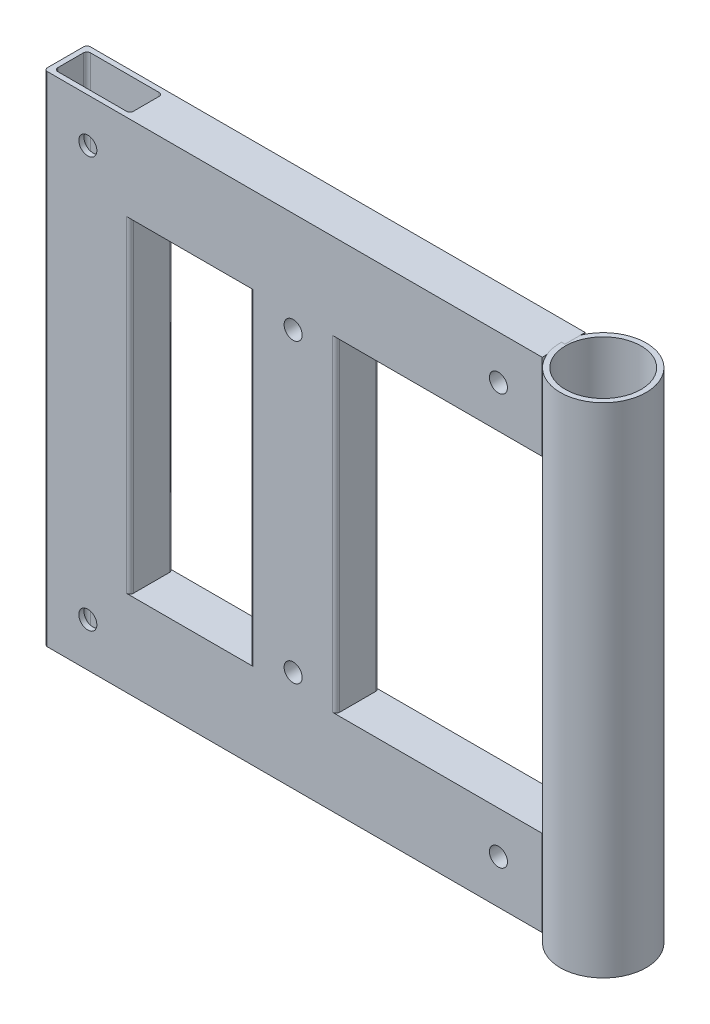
from build123d import *

# Parameters (mm, degrees)
ESQUISSE1_W             = 290
ESQUISSE1_H             = 290
ESQUISSE1_R             = 5.25
ESQUISSE1_W_2           = 70
ESQUISSE1_H_2           = 190
EXTRUSION1_DEPTH        = 25
CONG_2_R                = 2
ENL_V_MAT_EXTRU_1_DEPTH = 411.883195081
ESQUISSE4_W             = 52.968776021
ESQUISSE4_H             = 190
ENL_V_MAT_EXTRU_3_DEPTH = 411.883195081
ESQUISSE5_R             = 25
EXTRUSION2_DEPTH        = 290
ESQUISSE6_R             = 22
ENL_V_MAT_EXTRU_4_DEPTH = 447.934279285


with BuildPart() as part:
    # Esquisse1 → Extrusion1 (new body)
    with BuildSketch(Plane.XY):
        with Locations((145, -145)):
            Rectangle(ESQUISSE1_W, ESQUISSE1_H)
        with Locations((264.5, -25.5)):
            Circle(ESQUISSE1_R, mode=Mode.SUBTRACT)
        with Locations((25.5, -25.5)):
            Circle(ESQUISSE1_R, mode=Mode.SUBTRACT)
        with Locations((264.5, -264.5)):
            Circle(ESQUISSE1_R, mode=Mode.SUBTRACT)
        with Locations((25.5, -264.5)):
            Circle(ESQUISSE1_R, mode=Mode.SUBTRACT)
        with Locations((145, -58.675438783)):
            Circle(ESQUISSE1_R, mode=Mode.SUBTRACT)
        with Locations((145, -231.324561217)):
            Circle(ESQUISSE1_R, mode=Mode.SUBTRACT)
        with Locations((85, -145)):
            Rectangle(ESQUISSE1_W_2, ESQUISSE1_H_2, mode=Mode.SUBTRACT)
        with Locations((205, -145)):
            Rectangle(ESQUISSE1_W_2, ESQUISSE1_H_2, mode=Mode.SUBTRACT)
    extrude(amount=EXTRUSION1_DEPTH)

    # Cong_2
    cong_2_edges = [part.edges().sort_by_distance(p)[0] for p in [
        (50, -145, 0),
        (120, -145, 0),
        (50, -145, 25),
        (120, -145, 25),
        (170, -145, 0),
        (240, -145, 25),
        (170, -145, 25),
        (0, -145, 25),
        (0, -145, 0),
    ]]
    fillet(cong_2_edges, radius=CONG_2_R)

    # Esquisse2 → Enl_v. mat.-Extru.1 (cut, through all)
    with BuildSketch(Plane(origin=(0, 0, 0), x_dir=(1, 0, 0), z_dir=(0, 1, 0))):
        with BuildLine():
            Line((5, -3), (45, -3))
            ThreePointArc((45, -3), (46.414213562, -3.585786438), (47, -5))
            Line((47, -5), (47, -20))
            ThreePointArc((47, -20), (46.414213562, -21.414213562), (45, -22))
            Line((45, -22), (5, -22))
            ThreePointArc((5, -22), (3.585786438, -21.414213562), (3, -20))
            Line((3, -20), (3, -5))
            ThreePointArc((3, -5), (3.585786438, -3.585786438), (5, -3))
        make_face()
    extrude(amount=-ENL_V_MAT_EXTRU_1_DEPTH, mode=Mode.SUBTRACT)

    # Esquisse4 → Enl_v. mat.-Extru.3 (cut, through all)
    with BuildSketch(Plane.XY.offset(25)):
        with Locations((263.51561199, -145)):
            Rectangle(ESQUISSE4_W, ESQUISSE4_H)
    extrude(amount=-ENL_V_MAT_EXTRU_3_DEPTH, mode=Mode.SUBTRACT)


with BuildPart() as body_2:
    # Esquisse5 → Extrusion2 (new body)
    with BuildSketch(Plane(origin=(0, 0, 0), x_dir=(1, 0, 0), z_dir=(0, 1, 0))):
        with Locations(Location((313, -12.5, 0), (0, 0, 270))):
            Circle(ESQUISSE5_R)
    extrude(amount=-EXTRUSION2_DEPTH)

    # Esquisse6 → Enl_v. mat.-Extru.4 (cut, through all)
    with BuildSketch(Plane(origin=(0, 0, 0), x_dir=(1, 0, 0), z_dir=(0, 1, 0))):
        with Locations(Location((313, -12.5, 0), (0, 0, 270))):
            Circle(ESQUISSE6_R)
    extrude(amount=-ENL_V_MAT_EXTRU_4_DEPTH, mode=Mode.SUBTRACT)


solid = Compound([part.part, body_2.part])
